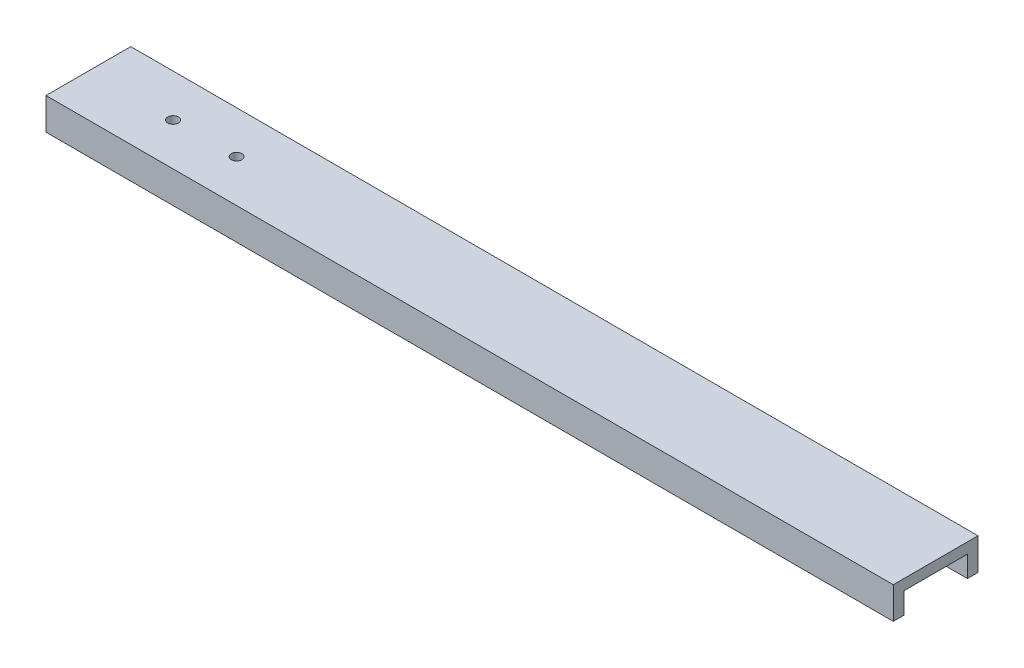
from build123d import *

# Parameters (mm, degrees)
BOSS_EXTRUDE2_DEPTH = 254
SKETCH3_R           = 3.175
CUT_EXTRUDE1_DEPTH  = 256.976683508


with BuildPart() as part:
    # Sketch2 → Boss-Extrude2 (new, symmetric)
    with BuildSketch(Plane(origin=(0, 0, 0), x_dir=(0, 0, -1), z_dir=(1, 0, 0))):
        Polygon((-25.4, -12.7), (-25.4, 6.35), (25.4, 6.35), (25.4, -12.7), (19.05, -12.7), (19.05, 0), (-19.05, 0), (-19.05, -12.7), align=None)
    extrude(amount=BOSS_EXTRUDE2_DEPTH, both=True)

    # Sketch3 → Cut-Extrude1 (cut, through all)
    with BuildSketch(Plane(origin=(0, 6.35, 0), x_dir=(1, 0, 0), z_dir=(0, 1, 0))):
        with Locations(Location((-203.2, 0, 0), (0, 0, 270))):
            Circle(SKETCH3_R)
        with Locations(Location((-165.1, 0, 0), (0, 0, 270))):
            Circle(SKETCH3_R)
    extrude(amount=-CUT_EXTRUDE1_DEPTH, mode=Mode.SUBTRACT)


solid = part.part
